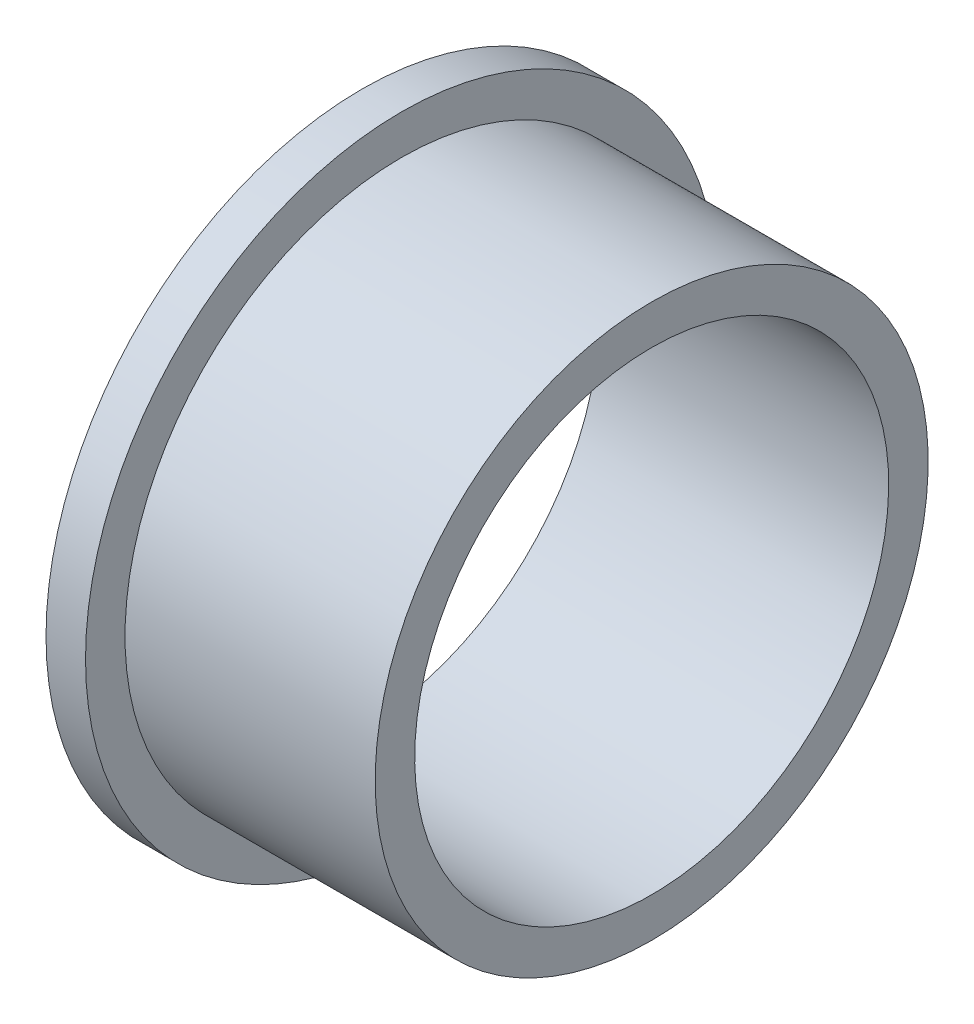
ISO-10303-21;
HEADER;
FILE_DESCRIPTION(('STEP AP214'),'2;1');
FILE_NAME('part.step','',(''),(''),'','','');
FILE_SCHEMA(('AUTOMOTIVE_DESIGN { 1 0 10303 214 1 1 1 1 }'));
ENDSEC;
DATA;
#1=APPLICATION_CONTEXT('core data for automotive mechanical design processes');
#2=APPLICATION_PROTOCOL_DEFINITION('international standard','automotive_design',2000,#1);
#3=PRODUCT_CONTEXT('',#1,'mechanical');
#4=PRODUCT('Part','Part','',(#3));
#5=PRODUCT_RELATED_PRODUCT_CATEGORY('part','',(#4));
#6=PRODUCT_DEFINITION_FORMATION('','',#4);
#7=PRODUCT_DEFINITION_CONTEXT('part definition',#1,'design');
#8=PRODUCT_DEFINITION('design','',#6,#7);
#9=PRODUCT_DEFINITION_SHAPE('','',#8);
#10=(LENGTH_UNIT() NAMED_UNIT(*) SI_UNIT(.MILLI.,.METRE.));
#11=(NAMED_UNIT(*) PLANE_ANGLE_UNIT() SI_UNIT($,.RADIAN.));
#12=(NAMED_UNIT(*) SI_UNIT($,.STERADIAN.) SOLID_ANGLE_UNIT());
#13=UNCERTAINTY_MEASURE_WITH_UNIT(LENGTH_MEASURE(1.E-05),#10,'distance_accuracy_value','');
#14=(GEOMETRIC_REPRESENTATION_CONTEXT(3) GLOBAL_UNCERTAINTY_ASSIGNED_CONTEXT((#13)) GLOBAL_UNIT_ASSIGNED_CONTEXT((#10,
#11,#12)) REPRESENTATION_CONTEXT('',''));
#15=CARTESIAN_POINT('',(0.,0.,0.));
#16=DIRECTION('',(0.,0.,1.));
#17=DIRECTION('',(1.,0.,0.));
#18=AXIS2_PLACEMENT_3D('',#15,#16,#17);
#19=CARTESIAN_POINT('',(0.,0.,0.));
#20=DIRECTION('',(1.,0.,0.));
#21=DIRECTION('',(0.,1.,0.));
#22=AXIS2_PLACEMENT_3D('',#19,#20,#21);
#23=CYLINDRICAL_SURFACE('',#22,24.);
#24=CARTESIAN_POINT('',(-22.,0.,0.));
#25=DIRECTION('',(1.,0.,0.));
#26=DIRECTION('',(0.,1.,0.));
#27=AXIS2_PLACEMENT_3D('',#24,#25,#26);
#28=CIRCLE('',#27,24.);
#29=CARTESIAN_POINT('',(-22.,24.,0.));
#30=VERTEX_POINT('',#29);
#31=EDGE_CURVE('E55',#30,#30,#28,.T.);
#32=ORIENTED_EDGE('',*,*,#31,.T.);
#33=EDGE_LOOP('',(#32));
#34=FACE_BOUND('',#33,.T.);
#35=CARTESIAN_POINT('',(-19.,0.,0.));
#36=DIRECTION('',(1.,0.,0.));
#37=DIRECTION('',(0.,1.,0.));
#38=AXIS2_PLACEMENT_3D('',#35,#36,#37);
#39=CIRCLE('',#38,24.);
#40=CARTESIAN_POINT('',(-19.,24.,0.));
#41=VERTEX_POINT('',#40);
#42=EDGE_CURVE('E10',#41,#41,#39,.T.);
#43=ORIENTED_EDGE('',*,*,#42,.F.);
#44=EDGE_LOOP('',(#43));
#45=FACE_BOUND('',#44,.T.);
#46=ADVANCED_FACE('F33',(#34,#45),#23,.T.);
#47=CARTESIAN_POINT('',(-19.,24.,0.));
#48=DIRECTION('',(1.,0.,0.));
#49=DIRECTION('',(0.,1.,0.));
#50=AXIS2_PLACEMENT_3D('',#47,#48,#49);
#51=PLANE('',#50);
#52=ORIENTED_EDGE('',*,*,#42,.T.);
#53=EDGE_LOOP('',(#52));
#54=FACE_BOUND('',#53,.T.);
#55=CARTESIAN_POINT('',(-19.,0.,0.));
#56=DIRECTION('',(1.,0.,0.));
#57=DIRECTION('',(0.,1.,0.));
#58=AXIS2_PLACEMENT_3D('',#55,#56,#57);
#59=CIRCLE('',#58,21.);
#60=CARTESIAN_POINT('',(-19.,21.,0.));
#61=VERTEX_POINT('',#60);
#62=EDGE_CURVE('E39',#61,#61,#59,.T.);
#63=ORIENTED_EDGE('',*,*,#62,.F.);
#64=EDGE_LOOP('',(#63));
#65=FACE_BOUND('',#64,.T.);
#66=ADVANCED_FACE('F73',(#54,#65),#51,.T.);
#67=CARTESIAN_POINT('',(0.,0.,0.));
#68=DIRECTION('',(1.,0.,0.));
#69=DIRECTION('',(0.,1.,0.));
#70=AXIS2_PLACEMENT_3D('',#67,#68,#69);
#71=CYLINDRICAL_SURFACE('',#70,21.);
#72=ORIENTED_EDGE('',*,*,#62,.T.);
#73=EDGE_LOOP('',(#72));
#74=FACE_BOUND('',#73,.T.);
#75=CARTESIAN_POINT('',(0.,0.,0.));
#76=DIRECTION('',(1.,0.,0.));
#77=DIRECTION('',(0.,1.,0.));
#78=AXIS2_PLACEMENT_3D('',#75,#76,#77);
#79=CIRCLE('',#78,21.);
#80=CARTESIAN_POINT('',(0.,21.,0.));
#81=VERTEX_POINT('',#80);
#82=EDGE_CURVE('E43',#81,#81,#79,.T.);
#83=ORIENTED_EDGE('',*,*,#82,.F.);
#84=EDGE_LOOP('',(#83));
#85=FACE_BOUND('',#84,.T.);
#86=ADVANCED_FACE('F77',(#74,#85),#71,.T.);
#87=CARTESIAN_POINT('',(0.,21.,0.));
#88=DIRECTION('',(1.,0.,0.));
#89=DIRECTION('',(0.,1.,0.));
#90=AXIS2_PLACEMENT_3D('',#87,#88,#89);
#91=PLANE('',#90);
#92=ORIENTED_EDGE('',*,*,#82,.T.);
#93=EDGE_LOOP('',(#92));
#94=FACE_BOUND('',#93,.T.);
#95=CARTESIAN_POINT('',(0.,0.,0.));
#96=DIRECTION('',(1.,0.,0.));
#97=DIRECTION('',(0.,1.,0.));
#98=AXIS2_PLACEMENT_3D('',#95,#96,#97);
#99=CIRCLE('',#98,18.);
#100=CARTESIAN_POINT('',(0.,18.,0.));
#101=VERTEX_POINT('',#100);
#102=EDGE_CURVE('E47',#101,#101,#99,.T.);
#103=ORIENTED_EDGE('',*,*,#102,.F.);
#104=EDGE_LOOP('',(#103));
#105=FACE_BOUND('',#104,.T.);
#106=ADVANCED_FACE('F69',(#94,#105),#91,.T.);
#107=CARTESIAN_POINT('',(0.,0.,0.));
#108=DIRECTION('',(1.,0.,0.));
#109=DIRECTION('',(0.,1.,0.));
#110=AXIS2_PLACEMENT_3D('',#107,#108,#109);
#111=CYLINDRICAL_SURFACE('',#110,18.);
#112=ORIENTED_EDGE('',*,*,#102,.T.);
#113=EDGE_LOOP('',(#112));
#114=FACE_BOUND('',#113,.T.);
#115=CARTESIAN_POINT('',(-22.,0.,0.));
#116=DIRECTION('',(1.,0.,0.));
#117=DIRECTION('',(0.,1.,0.));
#118=AXIS2_PLACEMENT_3D('',#115,#116,#117);
#119=CIRCLE('',#118,18.);
#120=CARTESIAN_POINT('',(-22.,18.,0.));
#121=VERTEX_POINT('',#120);
#122=EDGE_CURVE('E52',#121,#121,#119,.T.);
#123=ORIENTED_EDGE('',*,*,#122,.F.);
#124=EDGE_LOOP('',(#123));
#125=FACE_BOUND('',#124,.T.);
#126=ADVANCED_FACE('F63',(#114,#125),#111,.F.);
#127=CARTESIAN_POINT('',(-22.,18.,0.));
#128=DIRECTION('',(-1.,0.,0.));
#129=DIRECTION('',(0.,-1.,0.));
#130=AXIS2_PLACEMENT_3D('',#127,#128,#129);
#131=PLANE('',#130);
#132=ORIENTED_EDGE('',*,*,#122,.T.);
#133=EDGE_LOOP('',(#132));
#134=FACE_BOUND('',#133,.T.);
#135=ORIENTED_EDGE('',*,*,#31,.F.);
#136=EDGE_LOOP('',(#135));
#137=FACE_BOUND('',#136,.T.);
#138=ADVANCED_FACE('F61',(#134,#137),#131,.T.);
#139=CLOSED_SHELL('',(#46,#66,#86,#106,#126,#138));
#140=MANIFOLD_SOLID_BREP('B2',#139);
#141=ADVANCED_BREP_SHAPE_REPRESENTATION('',(#18,#140),#14);
#142=SHAPE_DEFINITION_REPRESENTATION(#9,#141);
ENDSEC;
END-ISO-10303-21;
